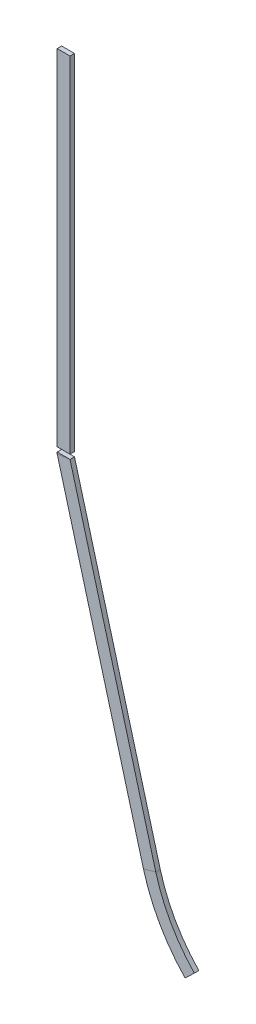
from build123d import *

# Parameters (mm, degrees)
SKETCH3_W          = 40
SKETCH3_H          = 14
SKETCH5_W          = 40
SKETCH5_H          = 14.000000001
CUT_EXTRUDE2_DEPTH = 14


with BuildPart() as part:
    # Sweep1: sweep along a path in Sketch2
    with BuildLine(Plane.XY) as sweep1_path:
        Line((-607.5, 2533), (-607.5, 1440.320997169))
        Line((-607.5, 1440.320997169), (-339.168568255, 456.68315125))
        ThreePointArc((-339.168568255, 456.68315125), (-290.437699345, 338.10001507), (-214.174352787, 235.043915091))
    # Sketch3 → Sweep1 (sweep)
    with BuildSketch(Plane(origin=(-607.5, 2533, 0), x_dir=(-1, 0, 0), z_dir=(0, -1, 0))):
        Rectangle(SKETCH3_W, SKETCH3_H)
    sweep(path=sweep1_path.line, transition=Transition.RIGHT)

    # Sketch5 → Cut-Extrude2 (cut)
    with BuildSketch(Plane.XY.offset(7)):
        with Locations((-607.5, 1450)):
            Rectangle(SKETCH5_W, SKETCH5_H)
    extrude(amount=-CUT_EXTRUDE2_DEPTH, mode=Mode.SUBTRACT)


with BuildPart() as cut_extrude2_piece_1:
    # of the separate pieces the step leaves, piece 1, a body of its own (cut_extrude2_pieces)
    add(part.part.solids().sort_by_distance((-627.5, 1443, -7))[0])


with BuildPart() as cut_extrude2_piece_2:
    # of the separate pieces the step leaves, piece 2, a body of its own (cut_extrude2_pieces)
    add(part.part.solids().sort_by_distance((-627.5, 2533, -7))[0])


solid = Compound([cut_extrude2_piece_1.part, cut_extrude2_piece_2.part])
